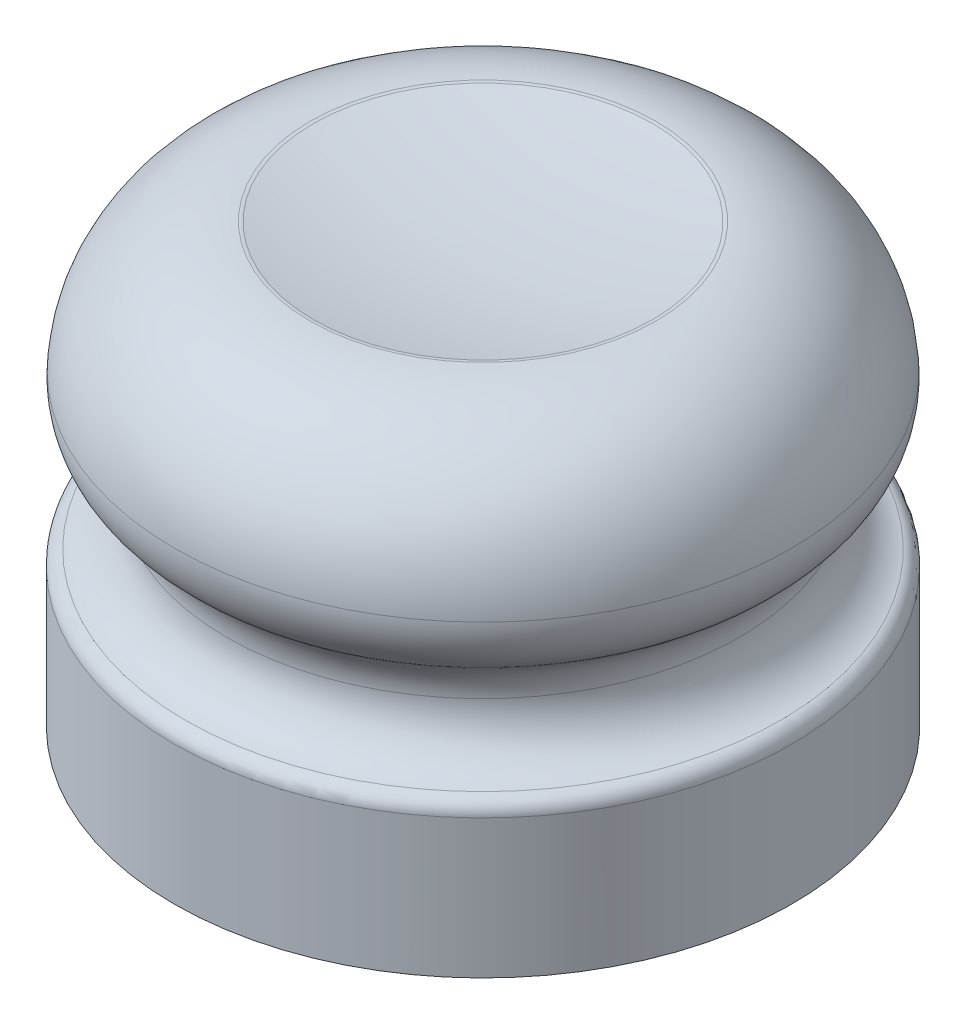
from build123d import *

# Parameters (mm, degrees)
DOME1_FACE_RADIUS = 28.585858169
DOME1_HEIGHT      = 3
FILLET1_R         = 2.5


with BuildPart() as part:
    # Sketch1 → Revolve1 (revolve)
    with BuildSketch(Plane.XY, mode=Mode.PRIVATE) as revolve1_sk:
        with BuildLine():
            Line((0, 0), (51.543895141, 0))
            Line((51.543895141, 0), (51.543895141, 25.344788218))
            ThreePointArc((51.543895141, 25.344788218), (45.330761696, 27.945031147), (42.776062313, 34.177029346))
            ThreePointArc((42.776062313, 34.177029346), (43.777214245, 38.19076894), (46.523544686, 41.284323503))
            ThreePointArc((46.523544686, 41.284323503), (50.306267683, 45.679084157), (51.449678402, 51.363758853))
            ThreePointArc((51.449678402, 51.363758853), (44.306759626, 66.698821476), (28.585858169, 72.946916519))
            Line((28.585858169, 72.946916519), (0, 72.946916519))
            Line((0, 72.946916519), (0, 0))
        make_face()
    revolve(revolve1_sk.sketch.rotate(Axis((0, 72.946916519, 0), (0, -1, 0)), 90), axis=Axis((0, 72.946916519, 0), (0, -1, 0)))

    # Dome1: a dome of height H over a round flat face of radius A is a cap of a sphere of radius (A * A + H * H) / (2 * H)
    dome1_r = (DOME1_FACE_RADIUS * DOME1_FACE_RADIUS + DOME1_HEIGHT * DOME1_HEIGHT) / (2 * DOME1_HEIGHT)
    dome1_base = Plane((0, 72.946916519, 0), z_dir=(0, -1, 0))
    with Locations(dome1_base.offset(DOME1_HEIGHT - dome1_r)):
        dome1_ball = Sphere(dome1_r, mode=Mode.PRIVATE)
    add(split(dome1_ball, bisect_by=dome1_base, keep=Keep.TOP, mode=Mode.PRIVATE), mode=Mode.SUBTRACT)

    # Fillet1
    fillet1_edges = [part.edges().sort_by_distance(p)[0] for p in [
        (0, 25.344788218, -51.543895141),
        (-28.585858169, 72.946916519, 0),
    ]]
    fillet(fillet1_edges, radius=FILLET1_R)


solid = part.part
